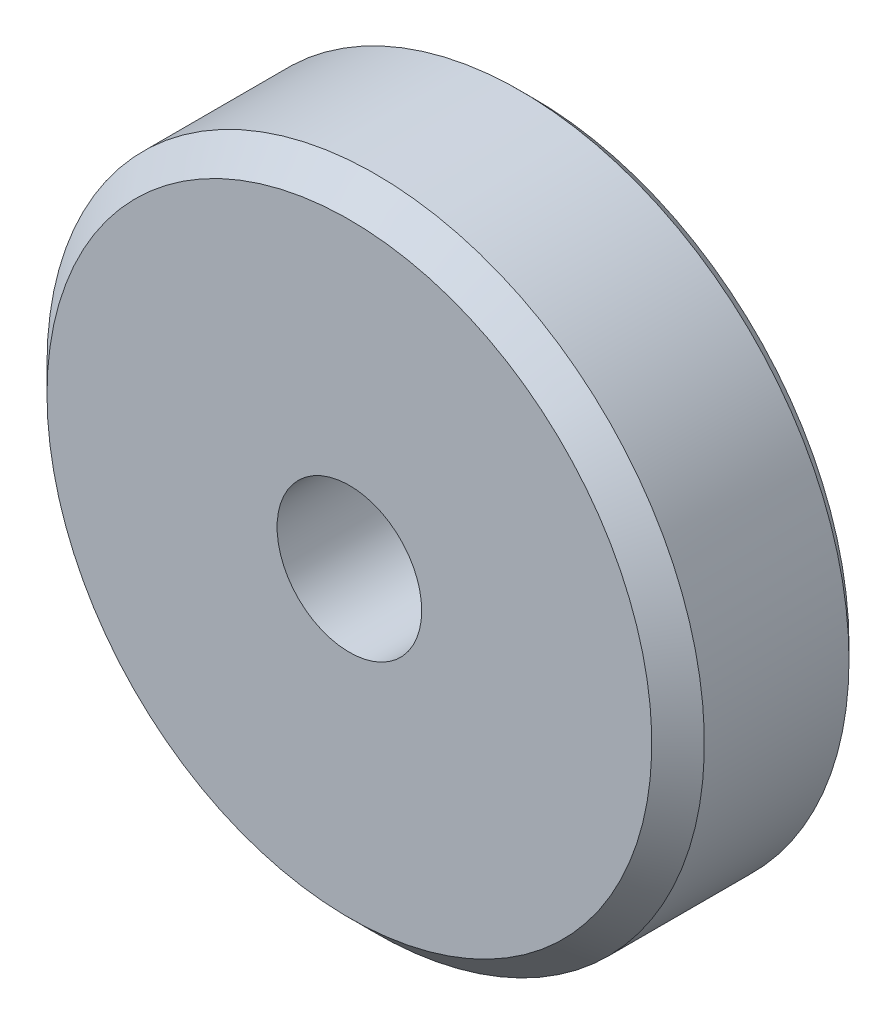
ISO-10303-21;
HEADER;
FILE_DESCRIPTION(('STEP AP214'),'2;1');
FILE_NAME('part.step','',(''),(''),'','','');
FILE_SCHEMA(('AUTOMOTIVE_DESIGN { 1 0 10303 214 1 1 1 1 }'));
ENDSEC;
DATA;
#1=APPLICATION_CONTEXT('core data for automotive mechanical design processes');
#2=APPLICATION_PROTOCOL_DEFINITION('international standard','automotive_design',2000,#1);
#3=PRODUCT_CONTEXT('',#1,'mechanical');
#4=PRODUCT('Part','Part','',(#3));
#5=PRODUCT_RELATED_PRODUCT_CATEGORY('part','',(#4));
#6=PRODUCT_DEFINITION_FORMATION('','',#4);
#7=PRODUCT_DEFINITION_CONTEXT('part definition',#1,'design');
#8=PRODUCT_DEFINITION('design','',#6,#7);
#9=PRODUCT_DEFINITION_SHAPE('','',#8);
#10=(LENGTH_UNIT() NAMED_UNIT(*) SI_UNIT(.MILLI.,.METRE.));
#11=(NAMED_UNIT(*) PLANE_ANGLE_UNIT() SI_UNIT($,.RADIAN.));
#12=(NAMED_UNIT(*) SI_UNIT($,.STERADIAN.) SOLID_ANGLE_UNIT());
#13=UNCERTAINTY_MEASURE_WITH_UNIT(LENGTH_MEASURE(1.E-05),#10,'distance_accuracy_value','');
#14=(GEOMETRIC_REPRESENTATION_CONTEXT(3) GLOBAL_UNCERTAINTY_ASSIGNED_CONTEXT((#13)) GLOBAL_UNIT_ASSIGNED_CONTEXT((#10,
#11,#12)) REPRESENTATION_CONTEXT('',''));
#15=CARTESIAN_POINT('',(0.,0.,0.));
#16=DIRECTION('',(0.,0.,1.));
#17=DIRECTION('',(1.,0.,0.));
#18=AXIS2_PLACEMENT_3D('',#15,#16,#17);
#19=CARTESIAN_POINT('',(0.,6.25000000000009,0.649999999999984));
#20=DIRECTION('',(0.,-1.,0.));
#21=DIRECTION('',(0.,0.,-1.));
#22=AXIS2_PLACEMENT_3D('',#19,#20,#21);
#23=CYLINDRICAL_SURFACE('',#22,1.25);
#24=CARTESIAN_POINT('',(0.,-2.75000000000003,-0.599999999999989));
#25=CARTESIAN_POINT('',(0.0664092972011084,-2.74999722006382,-0.599996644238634));
#26=CARTESIAN_POINT('',(0.132918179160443,-2.74756773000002,-0.594676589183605));
#27=CARTESIAN_POINT('',(0.264013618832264,-2.73809041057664,-0.573611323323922));
#28=CARTESIAN_POINT('',(0.328595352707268,-2.7310318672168,-0.557841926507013));
#29=CARTESIAN_POINT('',(0.453733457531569,-2.71304396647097,-0.516597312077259));
#30=CARTESIAN_POINT('',(0.514303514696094,-2.70212867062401,-0.491157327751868));
#31=CARTESIAN_POINT('',(0.630245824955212,-2.67746302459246,-0.431455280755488));
#32=CARTESIAN_POINT('',(0.68561911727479,-2.66371324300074,-0.39719498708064));
#33=CARTESIAN_POINT('',(0.79287640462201,-2.633838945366,-0.318757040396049));
#34=CARTESIAN_POINT('',(0.844423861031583,-2.61762758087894,-0.274152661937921));
#35=CARTESIAN_POINT('',(0.939605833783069,-2.58499080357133,-0.177200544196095));
#36=CARTESIAN_POINT('',(0.983235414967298,-2.56856526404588,-0.124848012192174));
#37=CARTESIAN_POINT('',(1.06399421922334,-2.53622246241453,-0.0100275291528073));
#38=CARTESIAN_POINT('',(1.10056379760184,-2.52039748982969,0.0528629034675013));
#39=CARTESIAN_POINT('',(1.162456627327,-2.49245983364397,0.18471600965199));
#40=CARTESIAN_POINT('',(1.18778672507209,-2.48034489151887,0.253674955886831));
#41=CARTESIAN_POINT('',(1.22502813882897,-2.46215702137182,0.39184774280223));
#42=CARTESIAN_POINT('',(1.2375915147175,-2.45579257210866,0.460845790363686));
#43=CARTESIAN_POINT('',(1.25096639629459,-2.44900910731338,0.600240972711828));
#44=CARTESIAN_POINT('',(1.25178632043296,-2.44858583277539,0.670637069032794));
#45=CARTESIAN_POINT('',(1.24213570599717,-2.45349076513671,0.803705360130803));
#46=CARTESIAN_POINT('',(1.23272508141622,-2.45827909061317,0.866478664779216));
#47=CARTESIAN_POINT('',(1.20468382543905,-2.47214054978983,0.989433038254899));
#48=CARTESIAN_POINT('',(1.18605099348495,-2.48121470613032,1.04961348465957));
#49=CARTESIAN_POINT('',(1.13972592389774,-2.50283604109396,1.16731828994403));
#50=CARTESIAN_POINT('',(1.11183710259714,-2.51545758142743,1.22475099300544));
#51=CARTESIAN_POINT('',(1.0479342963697,-2.54274244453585,1.33437072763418));
#52=CARTESIAN_POINT('',(1.01191682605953,-2.55740664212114,1.38655549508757));
#53=CARTESIAN_POINT('',(0.928462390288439,-2.58894610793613,1.48982328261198));
#54=CARTESIAN_POINT('',(0.880233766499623,-2.60589402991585,1.54024636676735));
#55=CARTESIAN_POINT('',(0.775874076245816,-2.6388468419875,1.63253413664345));
#56=CARTESIAN_POINT('',(0.719740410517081,-2.65485141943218,1.67439599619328));
#57=CARTESIAN_POINT('',(0.598831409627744,-2.68475267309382,1.74960334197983));
#58=CARTESIAN_POINT('',(0.533836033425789,-2.69856489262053,1.78263123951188));
#59=CARTESIAN_POINT('',(0.398422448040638,-2.7218496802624,1.83704419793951));
#60=CARTESIAN_POINT('',(0.328007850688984,-2.73132511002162,1.8584369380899));
#61=CARTESIAN_POINT('',(0.189224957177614,-2.74430245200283,1.88747768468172));
#62=CARTESIAN_POINT('',(0.12107724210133,-2.74818697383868,1.8960081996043));
#63=CARTESIAN_POINT('',(-0.0157830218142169,-2.75080503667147,1.90177344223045));
#64=CARTESIAN_POINT('',(-0.0844953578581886,-2.74954043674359,1.89901224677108));
#65=CARTESIAN_POINT('',(-0.216073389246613,-2.7422420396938,1.88285709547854));
#66=CARTESIAN_POINT('',(-0.27903906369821,-2.73650576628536,1.87012623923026));
#67=CARTESIAN_POINT('',(-0.401846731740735,-2.72118555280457,1.83536633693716));
#68=CARTESIAN_POINT('',(-0.461688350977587,-2.71160115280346,1.81333617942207));
#69=CARTESIAN_POINT('',(-0.578663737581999,-2.68910907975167,1.75991512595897));
#70=CARTESIAN_POINT('',(-0.635655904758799,-2.6761075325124,1.72825503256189));
#71=CARTESIAN_POINT('',(-0.743723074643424,-2.6481120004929,1.65676622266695));
#72=CARTESIAN_POINT('',(-0.794795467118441,-2.63311714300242,1.61693392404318));
#73=CARTESIAN_POINT('',(-0.894095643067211,-2.60116069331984,1.52634467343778));
#74=CARTESIAN_POINT('',(-0.941725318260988,-2.58413964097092,1.47495155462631));
#75=CARTESIAN_POINT('',(-1.02789777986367,-2.55109013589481,1.36471881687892));
#76=CARTESIAN_POINT('',(-1.066436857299,-2.53506209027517,1.3058761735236));
#77=CARTESIAN_POINT('',(-1.13425708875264,-2.50546837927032,1.18027291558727));
#78=CARTESIAN_POINT('',(-1.16325589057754,-2.49198214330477,1.11333962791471));
#79=CARTESIAN_POINT('',(-1.20928572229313,-2.46997777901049,0.974725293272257));
#80=CARTESIAN_POINT('',(-1.22632915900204,-2.46145450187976,0.903049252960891));
#81=CARTESIAN_POINT('',(-1.24662903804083,-2.45123100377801,0.763718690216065));
#82=CARTESIAN_POINT('',(-1.25095942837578,-2.44899997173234,0.696259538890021));
#83=CARTESIAN_POINT('',(-1.24868510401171,-2.45016089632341,0.56158345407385));
#84=CARTESIAN_POINT('',(-1.24208302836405,-2.45355149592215,0.494366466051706));
#85=CARTESIAN_POINT('',(-1.2190842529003,-2.46505170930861,0.366686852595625));
#86=CARTESIAN_POINT('',(-1.2033599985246,-2.47283643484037,0.306070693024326));
#87=CARTESIAN_POINT('',(-1.16329328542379,-2.4919346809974,0.188353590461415));
#88=CARTESIAN_POINT('',(-1.13894830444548,-2.50324923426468,0.131253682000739));
#89=CARTESIAN_POINT('',(-1.08052106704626,-2.52904242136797,0.0181064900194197));
#90=CARTESIAN_POINT('',(-1.04590750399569,-2.54367923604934,-0.0376295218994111));
#91=CARTESIAN_POINT('',(-0.968596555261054,-2.57411065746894,-0.142834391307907));
#92=CARTESIAN_POINT('',(-0.925895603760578,-2.5899057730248,-0.192300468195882));
#93=CARTESIAN_POINT('',(-0.828924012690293,-2.62263949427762,-0.28832995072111));
#94=CARTESIAN_POINT('',(-0.773945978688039,-2.63954746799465,-0.334193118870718));
#95=CARTESIAN_POINT('',(-0.656497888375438,-2.67118038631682,-0.416131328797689));
#96=CARTESIAN_POINT('',(-0.594024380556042,-2.6859043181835,-0.452201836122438));
#97=CARTESIAN_POINT('',(-0.463719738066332,-2.71142629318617,-0.513008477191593));
#98=CARTESIAN_POINT('',(-0.395940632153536,-2.72225776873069,-0.53784163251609));
#99=CARTESIAN_POINT('',(-0.256651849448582,-2.73888892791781,-0.57548039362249));
#100=CARTESIAN_POINT('',(-0.185154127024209,-2.7447037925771,-0.588322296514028));
#101=CARTESIAN_POINT('',(-0.0943030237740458,-2.74844792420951,-0.596581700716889));
#102=CARTESIAN_POINT('',(-0.0754723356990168,-2.74902888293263,-0.59786228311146));
#103=CARTESIAN_POINT('',(-0.0377637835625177,-2.74980531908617,-0.599571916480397));
#104=CARTESIAN_POINT('',(-0.0188859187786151,-2.75000079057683,-0.600000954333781));
#105=CARTESIAN_POINT('',(0.,-2.75000000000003,-0.599999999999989));
#106=B_SPLINE_CURVE_WITH_KNOTS('',3,(#24,#25,#26,#27,#28,#29,#30,#31,#32,#33,#34,#35,#36,#37,
#38,#39,#40,#41,#42,#43,#44,#45,#46,#47,#48,#49,#50,#51,#52,#53,#54,#55,#56,#57,#58,#59,#60,#61,
#62,#63,#64,#65,#66,#67,#68,#69,#70,#71,#72,#73,#74,#75,#76,#77,#78,#79,#80,#81,#82,#83,#84,#85,
#86,#87,#88,#89,#90,#91,#92,#93,#94,#95,#96,#97,#98,#99,#100,#101,#102,#103,#104,#105),
.UNSPECIFIED.,.T.,.F.,(4,2,2,2,2,2,2,2,2,2,2,2,2,2,2,2,2,2,2,2,2,2,2,2,2,2,2,2,2,2,2,2,2,2,2,2,
2,2,2,2,4),(0.,0.199150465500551,0.398763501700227,0.597656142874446,0.79650892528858,
1.00581702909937,1.21525514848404,1.43748275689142,1.65957481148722,1.86964669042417,
2.07956796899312,2.26964626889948,2.4597699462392,2.65422185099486,2.84875729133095,
3.0632118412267,3.27773707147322,3.49916919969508,3.72045500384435,3.92572957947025,
4.13093004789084,4.32353422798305,4.51616143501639,4.71476455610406,4.91345491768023,
5.1288142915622,5.34426138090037,5.56560701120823,5.78672259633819,5.98852995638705,
6.19028860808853,6.37878337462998,6.56733333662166,6.76817468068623,6.96910478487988,
7.18876214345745,7.40852104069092,7.62634457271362,7.843506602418,7.9001414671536,
7.95677720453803),.UNSPECIFIED.);
#107=CARTESIAN_POINT('',(-1.06770782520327,-2.53426517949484,1.66533453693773E-13));
#108=VERTEX_POINT('',#107);
#109=CARTESIAN_POINT('',(1.06770782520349,-2.53426517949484,-1.66533453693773E-13));
#110=VERTEX_POINT('',#109);
#111=EDGE_CURVE('E73',#108,#110,#106,.T.);
#112=ORIENTED_EDGE('',*,*,#111,.T.);
#113=DIRECTION('',(0.,-1.,0.));
#114=VECTOR('',#113,1.);
#115=CARTESIAN_POINT('',(1.06770782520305,6.24999999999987,0.));
#116=LINE('',#115,#114);
#117=CARTESIAN_POINT('',(1.06770782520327,-6.24999999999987,0.));
#118=VERTEX_POINT('',#117);
#119=EDGE_CURVE('E144',#110,#118,#116,.T.);
#120=ORIENTED_EDGE('',*,*,#119,.T.);
#121=CARTESIAN_POINT('',(0.,-6.24999999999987,0.649999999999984));
#122=DIRECTION('',(0.,1.,0.));
#123=DIRECTION('',(0.,0.,1.));
#124=AXIS2_PLACEMENT_3D('',#121,#122,#123);
#125=CIRCLE('',#124,1.25);
#126=CARTESIAN_POINT('',(-1.06770782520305,-6.24999999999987,0.));
#127=VERTEX_POINT('',#126);
#128=EDGE_CURVE('E88',#118,#127,#125,.T.);
#129=ORIENTED_EDGE('',*,*,#128,.T.);
#130=DIRECTION('',(0.,-1.,0.));
#131=VECTOR('',#130,1.);
#132=CARTESIAN_POINT('',(-1.06770782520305,6.25000000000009,0.));
#133=LINE('',#132,#131);
#134=EDGE_CURVE('E86',#127,#108,#133,.F.);
#135=ORIENTED_EDGE('',*,*,#134,.T.);
#136=EDGE_LOOP('',(#112,#120,#129,#135));
#137=FACE_BOUND('',#136,.T.);
#138=ADVANCED_FACE('F30',(#137),#23,.T.);
#139=CARTESIAN_POINT('',(0.,0.,7.00000000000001));
#140=DIRECTION('',(0.,0.,-1.));
#141=DIRECTION('',(-1.,0.,0.));
#142=AXIS2_PLACEMENT_3D('',#139,#140,#141);
#143=CYLINDRICAL_SURFACE('',#142,12.5);
#144=CARTESIAN_POINT('',(0.,0.,0.5));
#145=DIRECTION('',(0.,0.,1.));
#146=DIRECTION('',(1.,0.,0.));
#147=AXIS2_PLACEMENT_3D('',#144,#145,#146);
#148=CIRCLE('',#147,12.5);
#149=CARTESIAN_POINT('',(-12.5,0.,0.5));
#150=VERTEX_POINT('',#149);
#151=EDGE_CURVE('E38',#150,#150,#148,.T.);
#152=CARTESIAN_POINT('',(0.,0.,6.00000000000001));
#153=DIRECTION('',(0.,0.,1.));
#154=DIRECTION('',(1.,0.,0.));
#155=AXIS2_PLACEMENT_3D('',#152,#153,#154);
#156=CIRCLE('',#155,12.5);
#157=CARTESIAN_POINT('',(-12.5,0.,6.00000000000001));
#158=VERTEX_POINT('',#157);
#159=EDGE_CURVE('E139',#158,#158,#156,.F.);
#160=CARTESIAN_POINT('',(-12.5,0.,0.5));
#161=CARTESIAN_POINT('',(-12.5,0.,0.557291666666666));
#162=CARTESIAN_POINT('',(-12.5,0.,0.614583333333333));
#163=CARTESIAN_POINT('',(-12.5,0.,0.729166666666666));
#164=CARTESIAN_POINT('',(-12.5,0.,0.786458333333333));
#165=CARTESIAN_POINT('',(-12.5,0.,0.901041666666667));
#166=CARTESIAN_POINT('',(-12.5,0.,0.958333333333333));
#167=CARTESIAN_POINT('',(-12.5,0.,1.07291666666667));
#168=CARTESIAN_POINT('',(-12.5,0.,1.13020833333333));
#169=CARTESIAN_POINT('',(-12.5,0.,1.24479166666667));
#170=CARTESIAN_POINT('',(-12.5,0.,1.30208333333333));
#171=CARTESIAN_POINT('',(-12.5,0.,1.41666666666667));
#172=CARTESIAN_POINT('',(-12.5,0.,1.47395833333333));
#173=CARTESIAN_POINT('',(-12.5,0.,1.58854166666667));
#174=CARTESIAN_POINT('',(-12.5,0.,1.64583333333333));
#175=CARTESIAN_POINT('',(-12.5,0.,1.76041666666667));
#176=CARTESIAN_POINT('',(-12.5,0.,1.81770833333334));
#177=CARTESIAN_POINT('',(-12.5,0.,1.93229166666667));
#178=CARTESIAN_POINT('',(-12.5,0.,1.98958333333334));
#179=CARTESIAN_POINT('',(-12.5,0.,2.10416666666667));
#180=CARTESIAN_POINT('',(-12.5,0.,2.16145833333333));
#181=CARTESIAN_POINT('',(-12.5,0.,2.27604166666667));
#182=CARTESIAN_POINT('',(-12.5,0.,2.33333333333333));
#183=CARTESIAN_POINT('',(-12.5,0.,2.44791666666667));
#184=CARTESIAN_POINT('',(-12.5,0.,2.50520833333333));
#185=CARTESIAN_POINT('',(-12.5,0.,2.61979166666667));
#186=CARTESIAN_POINT('',(-12.5,0.,2.67708333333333));
#187=CARTESIAN_POINT('',(-12.5,0.,2.79166666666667));
#188=CARTESIAN_POINT('',(-12.5,0.,2.84895833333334));
#189=CARTESIAN_POINT('',(-12.5,0.,2.96354166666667));
#190=CARTESIAN_POINT('',(-12.5,0.,3.02083333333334));
#191=CARTESIAN_POINT('',(-12.5,0.,3.13541666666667));
#192=CARTESIAN_POINT('',(-12.5,0.,3.19270833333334));
#193=CARTESIAN_POINT('',(-12.5,0.,3.30729166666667));
#194=CARTESIAN_POINT('',(-12.5,0.,3.36458333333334));
#195=CARTESIAN_POINT('',(-12.5,0.,3.47916666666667));
#196=CARTESIAN_POINT('',(-12.5,0.,3.53645833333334));
#197=CARTESIAN_POINT('',(-12.5,0.,3.65104166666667));
#198=CARTESIAN_POINT('',(-12.5,0.,3.70833333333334));
#199=CARTESIAN_POINT('',(-12.5,0.,3.82291666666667));
#200=CARTESIAN_POINT('',(-12.5,0.,3.88020833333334));
#201=CARTESIAN_POINT('',(-12.5,0.,3.99479166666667));
#202=CARTESIAN_POINT('',(-12.5,0.,4.05208333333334));
#203=CARTESIAN_POINT('',(-12.5,0.,4.16666666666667));
#204=CARTESIAN_POINT('',(-12.5,0.,4.22395833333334));
#205=CARTESIAN_POINT('',(-12.5,0.,4.33854166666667));
#206=CARTESIAN_POINT('',(-12.5,0.,4.39583333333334));
#207=CARTESIAN_POINT('',(-12.5,0.,4.51041666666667));
#208=CARTESIAN_POINT('',(-12.5,0.,4.56770833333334));
#209=CARTESIAN_POINT('',(-12.5,0.,4.68229166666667));
#210=CARTESIAN_POINT('',(-12.5,0.,4.73958333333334));
#211=CARTESIAN_POINT('',(-12.5,0.,4.85416666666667));
#212=CARTESIAN_POINT('',(-12.5,0.,4.91145833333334));
#213=CARTESIAN_POINT('',(-12.5,0.,5.02604166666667));
#214=CARTESIAN_POINT('',(-12.5,0.,5.08333333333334));
#215=CARTESIAN_POINT('',(-12.5,0.,5.19791666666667));
#216=CARTESIAN_POINT('',(-12.5,0.,5.25520833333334));
#217=CARTESIAN_POINT('',(-12.5,0.,5.36979166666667));
#218=CARTESIAN_POINT('',(-12.5,0.,5.42708333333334));
#219=CARTESIAN_POINT('',(-12.5,0.,5.54166666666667));
#220=CARTESIAN_POINT('',(-12.5,0.,5.59895833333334));
#221=CARTESIAN_POINT('',(-12.5,0.,5.71354166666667));
#222=CARTESIAN_POINT('',(-12.5,0.,5.77083333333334));
#223=CARTESIAN_POINT('',(-12.5,0.,5.88541666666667));
#224=CARTESIAN_POINT('',(-12.5,0.,5.94270833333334));
#225=CARTESIAN_POINT('',(-12.5,0.,6.00000000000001));
#226=B_SPLINE_CURVE_WITH_KNOTS('',3,(#160,#161,#162,#163,#164,#165,#166,#167,#168,#169,#170,
#171,#172,#173,#174,#175,#176,#177,#178,#179,#180,#181,#182,#183,#184,#185,#186,#187,#188,#189,
#190,#191,#192,#193,#194,#195,#196,#197,#198,#199,#200,#201,#202,#203,#204,#205,#206,#207,#208,
#209,#210,#211,#212,#213,#214,#215,#216,#217,#218,#219,#220,#221,#222,#223,#224,#225),
.UNSPECIFIED.,.F.,.F.,(4,2,2,2,2,2,2,2,2,2,2,2,2,2,2,2,2,2,2,2,2,2,2,2,2,2,2,2,2,2,2,2,4),(0.,
0.171875,0.34375,0.515625,0.687500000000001,0.859375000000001,1.03125,1.203125,1.375,1.546875,
1.71875,1.890625,2.0625,2.234375,2.40625,2.578125,2.75,2.921875,3.09375,3.265625,3.4375,
3.609375,3.78125,3.953125,4.125,4.296875,4.46875,4.64062500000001,4.81250000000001,
4.98437500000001,5.15625000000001,5.32812500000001,5.50000000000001),.UNSPECIFIED.);
#227=EDGE_CURVE('BSEAM32',#150,#158,#226,.T.);
#228=ORIENTED_EDGE('',*,*,#151,.T.);
#229=ORIENTED_EDGE('',*,*,#159,.T.);
#230=ORIENTED_EDGE('',*,*,#227,.T.);
#231=ORIENTED_EDGE('',*,*,#227,.F.);
#232=EDGE_LOOP('',(#228,#230,#229,#231));
#233=FACE_BOUND('',#232,.T.);
#234=ADVANCED_FACE('F32',(#233),#143,.T.);
#235=CARTESIAN_POINT('',(0.,0.,7.00000000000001));
#236=DIRECTION('',(0.,0.,1.));
#237=DIRECTION('',(1.,0.,0.));
#238=AXIS2_PLACEMENT_3D('',#235,#236,#237);
#239=PLANE('',#238);
#240=CARTESIAN_POINT('',(0.,0.,7.00000000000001));
#241=DIRECTION('',(0.,0.,1.));
#242=DIRECTION('',(1.,0.,0.));
#243=AXIS2_PLACEMENT_3D('',#240,#241,#242);
#244=CIRCLE('',#243,2.75);
#245=CARTESIAN_POINT('',(2.75,0.,7.00000000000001));
#246=VERTEX_POINT('',#245);
#247=EDGE_CURVE('E152',#246,#246,#244,.T.);
#248=ORIENTED_EDGE('',*,*,#247,.F.);
#249=EDGE_LOOP('',(#248));
#250=FACE_BOUND('',#249,.T.);
#251=CARTESIAN_POINT('',(0.,0.,7.00000000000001));
#252=DIRECTION('',(0.,0.,1.));
#253=DIRECTION('',(1.,0.,0.));
#254=AXIS2_PLACEMENT_3D('',#251,#252,#253);
#255=CIRCLE('',#254,11.5);
#256=CARTESIAN_POINT('',(-11.5,0.,7.00000000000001));
#257=VERTEX_POINT('',#256);
#258=EDGE_CURVE('E142',#257,#257,#255,.T.);
#259=ORIENTED_EDGE('',*,*,#258,.T.);
#260=EDGE_LOOP('',(#259));
#261=FACE_BOUND('',#260,.T.);
#262=ADVANCED_FACE('F128',(#250,#261),#239,.T.);
#263=CARTESIAN_POINT('',(0.,0.,0.));
#264=DIRECTION('',(0.,0.,1.));
#265=DIRECTION('',(1.,0.,0.));
#266=AXIS2_PLACEMENT_3D('',#263,#264,#265);
#267=PLANE('',#266);
#268=CARTESIAN_POINT('',(0.,0.,0.));
#269=DIRECTION('',(0.,0.,1.));
#270=DIRECTION('',(1.,0.,0.));
#271=AXIS2_PLACEMENT_3D('',#268,#269,#270);
#272=CIRCLE('',#271,12.);
#273=CARTESIAN_POINT('',(12.,0.,0.));
#274=VERTEX_POINT('',#273);
#275=EDGE_CURVE('E11',#274,#274,#272,.F.);
#276=ORIENTED_EDGE('',*,*,#275,.T.);
#277=EDGE_LOOP('',(#276));
#278=FACE_BOUND('',#277,.T.);
#279=CARTESIAN_POINT('',(-1.06770782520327,2.53426517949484,0.));
#280=VERTEX_POINT('',#279);
#281=CARTESIAN_POINT('',(-1.06770782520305,6.25000000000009,0.));
#282=VERTEX_POINT('',#281);
#283=EDGE_CURVE('E45',#280,#282,#133,.F.);
#284=ORIENTED_EDGE('',*,*,#283,.F.);
#285=CARTESIAN_POINT('',(0.,0.,0.));
#286=DIRECTION('',(0.,0.,1.));
#287=DIRECTION('',(1.,0.,0.));
#288=AXIS2_PLACEMENT_3D('',#285,#286,#287);
#289=CIRCLE('',#288,2.75);
#290=EDGE_CURVE('E76',#280,#108,#289,.T.);
#291=ORIENTED_EDGE('',*,*,#290,.T.);
#292=ORIENTED_EDGE('',*,*,#134,.F.);
#293=DIRECTION('',(-1.,0.,0.));
#294=VECTOR('',#293,1.);
#295=CARTESIAN_POINT('',(0.,-6.24999999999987,0.));
#296=LINE('',#295,#294);
#297=EDGE_CURVE('E141',#118,#127,#296,.T.);
#298=ORIENTED_EDGE('',*,*,#297,.F.);
#299=ORIENTED_EDGE('',*,*,#119,.F.);
#300=CARTESIAN_POINT('',(1.06770782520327,2.53426517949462,0.));
#301=VERTEX_POINT('',#300);
#302=EDGE_CURVE('E77',#110,#301,#289,.T.);
#303=ORIENTED_EDGE('',*,*,#302,.T.);
#304=CARTESIAN_POINT('',(1.06770782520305,6.24999999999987,0.));
#305=VERTEX_POINT('',#304);
#306=EDGE_CURVE('E52',#305,#301,#116,.T.);
#307=ORIENTED_EDGE('',*,*,#306,.F.);
#308=DIRECTION('',(-1.,0.,0.));
#309=VECTOR('',#308,1.);
#310=CARTESIAN_POINT('',(0.,6.25000000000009,0.));
#311=LINE('',#310,#309);
#312=EDGE_CURVE('E82',#305,#282,#311,.T.);
#313=ORIENTED_EDGE('',*,*,#312,.T.);
#314=EDGE_LOOP('',(#284,#291,#292,#298,#299,#303,#307,#313));
#315=FACE_BOUND('',#314,.T.);
#316=ADVANCED_FACE('F84',(#278,#315),#267,.F.);
#317=CARTESIAN_POINT('',(0.,0.,7.00000000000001));
#318=DIRECTION('',(0.,0.,-1.));
#319=DIRECTION('',(-1.,0.,0.));
#320=AXIS2_PLACEMENT_3D('',#317,#318,#319);
#321=CONICAL_SURFACE('',#320,11.5,0.785398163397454);
#322=CARTESIAN_POINT('',(-12.5,0.,6.00000000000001));
#323=CARTESIAN_POINT('',(-12.4895833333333,0.,6.01041666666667));
#324=CARTESIAN_POINT('',(-12.4791666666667,0.,6.02083333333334));
#325=CARTESIAN_POINT('',(-12.4583333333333,0.,6.04166666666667));
#326=CARTESIAN_POINT('',(-12.4479166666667,0.,6.05208333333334));
#327=CARTESIAN_POINT('',(-12.4270833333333,0.,6.07291666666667));
#328=CARTESIAN_POINT('',(-12.4166666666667,0.,6.08333333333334));
#329=CARTESIAN_POINT('',(-12.3958333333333,0.,6.10416666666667));
#330=CARTESIAN_POINT('',(-12.3854166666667,0.,6.11458333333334));
#331=CARTESIAN_POINT('',(-12.3645833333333,0.,6.13541666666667));
#332=CARTESIAN_POINT('',(-12.3541666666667,0.,6.14583333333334));
#333=CARTESIAN_POINT('',(-12.3333333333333,0.,6.16666666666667));
#334=CARTESIAN_POINT('',(-12.3229166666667,0.,6.17708333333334));
#335=CARTESIAN_POINT('',(-12.3020833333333,0.,6.19791666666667));
#336=CARTESIAN_POINT('',(-12.2916666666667,0.,6.20833333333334));
#337=CARTESIAN_POINT('',(-12.2708333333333,0.,6.22916666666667));
#338=CARTESIAN_POINT('',(-12.2604166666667,0.,6.23958333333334));
#339=CARTESIAN_POINT('',(-12.2395833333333,0.,6.26041666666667));
#340=CARTESIAN_POINT('',(-12.2291666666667,0.,6.27083333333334));
#341=CARTESIAN_POINT('',(-12.2083333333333,0.,6.29166666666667));
#342=CARTESIAN_POINT('',(-12.1979166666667,0.,6.30208333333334));
#343=CARTESIAN_POINT('',(-12.1770833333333,0.,6.32291666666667));
#344=CARTESIAN_POINT('',(-12.1666666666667,0.,6.33333333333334));
#345=CARTESIAN_POINT('',(-12.1458333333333,0.,6.35416666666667));
#346=CARTESIAN_POINT('',(-12.1354166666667,0.,6.36458333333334));
#347=CARTESIAN_POINT('',(-12.1145833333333,0.,6.38541666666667));
#348=CARTESIAN_POINT('',(-12.1041666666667,0.,6.39583333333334));
#349=CARTESIAN_POINT('',(-12.0833333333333,0.,6.41666666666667));
#350=CARTESIAN_POINT('',(-12.0729166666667,0.,6.42708333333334));
#351=CARTESIAN_POINT('',(-12.0520833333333,0.,6.44791666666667));
#352=CARTESIAN_POINT('',(-12.0416666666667,0.,6.45833333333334));
#353=CARTESIAN_POINT('',(-12.0208333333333,0.,6.47916666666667));
#354=CARTESIAN_POINT('',(-12.0104166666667,0.,6.48958333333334));
#355=CARTESIAN_POINT('',(-11.9895833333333,0.,6.51041666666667));
#356=CARTESIAN_POINT('',(-11.9791666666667,0.,6.52083333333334));
#357=CARTESIAN_POINT('',(-11.9583333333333,0.,6.54166666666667));
#358=CARTESIAN_POINT('',(-11.9479166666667,0.,6.55208333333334));
#359=CARTESIAN_POINT('',(-11.9270833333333,0.,6.57291666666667));
#360=CARTESIAN_POINT('',(-11.9166666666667,0.,6.58333333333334));
#361=CARTESIAN_POINT('',(-11.8958333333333,0.,6.60416666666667));
#362=CARTESIAN_POINT('',(-11.8854166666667,0.,6.61458333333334));
#363=CARTESIAN_POINT('',(-11.8645833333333,0.,6.63541666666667));
#364=CARTESIAN_POINT('',(-11.8541666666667,0.,6.64583333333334));
#365=CARTESIAN_POINT('',(-11.8333333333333,0.,6.66666666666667));
#366=CARTESIAN_POINT('',(-11.8229166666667,0.,6.67708333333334));
#367=CARTESIAN_POINT('',(-11.8020833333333,0.,6.69791666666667));
#368=CARTESIAN_POINT('',(-11.7916666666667,0.,6.70833333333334));
#369=CARTESIAN_POINT('',(-11.7708333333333,0.,6.72916666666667));
#370=CARTESIAN_POINT('',(-11.7604166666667,0.,6.73958333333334));
#371=CARTESIAN_POINT('',(-11.7395833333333,0.,6.76041666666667));
#372=CARTESIAN_POINT('',(-11.7291666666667,0.,6.77083333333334));
#373=CARTESIAN_POINT('',(-11.7083333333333,0.,6.79166666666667));
#374=CARTESIAN_POINT('',(-11.6979166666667,0.,6.80208333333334));
#375=CARTESIAN_POINT('',(-11.6770833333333,0.,6.82291666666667));
#376=CARTESIAN_POINT('',(-11.6666666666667,0.,6.83333333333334));
#377=CARTESIAN_POINT('',(-11.6458333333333,0.,6.85416666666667));
#378=CARTESIAN_POINT('',(-11.6354166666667,0.,6.86458333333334));
#379=CARTESIAN_POINT('',(-11.6145833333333,0.,6.88541666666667));
#380=CARTESIAN_POINT('',(-11.6041666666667,0.,6.89583333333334));
#381=CARTESIAN_POINT('',(-11.5833333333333,0.,6.91666666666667));
#382=CARTESIAN_POINT('',(-11.5729166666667,0.,6.92708333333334));
#383=CARTESIAN_POINT('',(-11.5520833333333,0.,6.94791666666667));
#384=CARTESIAN_POINT('',(-11.5416666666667,0.,6.95833333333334));
#385=CARTESIAN_POINT('',(-11.5208333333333,0.,6.97916666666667));
#386=CARTESIAN_POINT('',(-11.5104166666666,0.,6.98958333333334));
#387=CARTESIAN_POINT('',(-11.5,0.,7.00000000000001));
#388=B_SPLINE_CURVE_WITH_KNOTS('',3,(#322,#323,#324,#325,#326,#327,#328,#329,#330,#331,#332,
#333,#334,#335,#336,#337,#338,#339,#340,#341,#342,#343,#344,#345,#346,#347,#348,#349,#350,#351,
#352,#353,#354,#355,#356,#357,#358,#359,#360,#361,#362,#363,#364,#365,#366,#367,#368,#369,#370,
#371,#372,#373,#374,#375,#376,#377,#378,#379,#380,#381,#382,#383,#384,#385,#386,#387),
.UNSPECIFIED.,.F.,.F.,(4,2,2,2,2,2,2,2,2,2,2,2,2,2,2,2,2,2,2,2,2,2,2,2,2,2,2,2,2,2,2,2,4),(0.,
0.0441941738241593,0.0883883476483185,0.132582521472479,0.176776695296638,0.220970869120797,
0.265165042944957,0.309359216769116,0.353553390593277,0.397747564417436,0.441941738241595,
0.486135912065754,0.530330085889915,0.574524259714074,0.618718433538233,0.662912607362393,
0.707106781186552,0.751300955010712,0.795495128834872,0.83968930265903,0.88388347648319,
0.928077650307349,0.97227182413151,1.01646599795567,1.06066017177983,1.10485434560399,
1.14904851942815,1.19324269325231,1.23743686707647,1.28163104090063,1.32582521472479,
1.37001938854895,1.41421356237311),.UNSPECIFIED.);
#389=EDGE_CURVE('BSEAM123',#158,#257,#388,.T.);
#390=ORIENTED_EDGE('',*,*,#159,.F.);
#391=ORIENTED_EDGE('',*,*,#258,.F.);
#392=ORIENTED_EDGE('',*,*,#389,.T.);
#393=ORIENTED_EDGE('',*,*,#389,.F.);
#394=EDGE_LOOP('',(#390,#392,#391,#393));
#395=FACE_BOUND('',#394,.T.);
#396=ADVANCED_FACE('F123',(#395),#321,.T.);
#397=CARTESIAN_POINT('',(2.22044604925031E-13,2.75000000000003,-0.599999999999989));
#398=CARTESIAN_POINT('',(-0.0664092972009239,2.74999722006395,-0.59999664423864));
#399=CARTESIAN_POINT('',(-0.132918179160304,2.74756773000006,-0.59467658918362));
#400=CARTESIAN_POINT('',(-0.2640136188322,2.73809041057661,-0.573611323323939));
#401=CARTESIAN_POINT('',(-0.328595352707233,2.73103186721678,-0.557841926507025));
#402=CARTESIAN_POINT('',(-0.453733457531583,2.713043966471,-0.516597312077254));
#403=CARTESIAN_POINT('',(-0.514303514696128,2.70212867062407,-0.491157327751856));
#404=CARTESIAN_POINT('',(-0.630245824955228,2.67746302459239,-0.431455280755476));
#405=CARTESIAN_POINT('',(-0.685619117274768,2.66371324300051,-0.397194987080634));
#406=CARTESIAN_POINT('',(-0.792876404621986,2.6338389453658,-0.318757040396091));
#407=CARTESIAN_POINT('',(-0.844423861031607,2.61762758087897,-0.27415266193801));
#408=CARTESIAN_POINT('',(-0.9396058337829,2.58499080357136,-0.177200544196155));
#409=CARTESIAN_POINT('',(-0.983235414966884,2.56856526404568,-0.124848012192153));
#410=CARTESIAN_POINT('',(-1.06399421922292,2.53622246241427,-0.0100275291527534));
#411=CARTESIAN_POINT('',(-1.10056379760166,2.52039748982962,0.0528629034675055));
#412=CARTESIAN_POINT('',(-1.16245662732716,2.49245983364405,0.184716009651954));
#413=CARTESIAN_POINT('',(-1.18778672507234,2.48034489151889,0.253674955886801));
#414=CARTESIAN_POINT('',(-1.22502813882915,2.4621570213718,0.391847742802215));
#415=CARTESIAN_POINT('',(-1.23759151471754,2.45579257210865,0.460845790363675));
#416=CARTESIAN_POINT('',(-1.25096639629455,2.44900910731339,0.600240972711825));
#417=CARTESIAN_POINT('',(-1.25178632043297,2.44858583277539,0.670637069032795));
#418=CARTESIAN_POINT('',(-1.24213570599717,2.45349076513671,0.803705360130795));
#419=CARTESIAN_POINT('',(-1.23272508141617,2.45827909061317,0.866478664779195));
#420=CARTESIAN_POINT('',(-1.2046838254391,2.47214054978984,0.989433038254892));
#421=CARTESIAN_POINT('',(-1.18605099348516,2.48121470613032,1.04961348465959));
#422=CARTESIAN_POINT('',(-1.13972592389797,2.50283604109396,1.16731828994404));
#423=CARTESIAN_POINT('',(-1.11183710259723,2.51545758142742,1.2247509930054));
#424=CARTESIAN_POINT('',(-1.04793429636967,2.54274244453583,1.33437072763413));
#425=CARTESIAN_POINT('',(-1.01191682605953,2.55740664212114,1.38655549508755));
#426=CARTESIAN_POINT('',(-0.928462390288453,2.58894610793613,1.48982328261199));
#427=CARTESIAN_POINT('',(-0.880233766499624,2.60589402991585,1.54024636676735));
#428=CARTESIAN_POINT('',(-0.775874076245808,2.6388468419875,1.63253413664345));
#429=CARTESIAN_POINT('',(-0.719740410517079,2.65485141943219,1.67439599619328));
#430=CARTESIAN_POINT('',(-0.598831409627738,2.68475267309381,1.74960334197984));
#431=CARTESIAN_POINT('',(-0.533836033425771,2.69856489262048,1.78263123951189));
#432=CARTESIAN_POINT('',(-0.398422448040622,2.72184968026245,1.83704419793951));
#433=CARTESIAN_POINT('',(-0.328007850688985,2.73132511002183,1.8584369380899));
#434=CARTESIAN_POINT('',(-0.189224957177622,2.74430245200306,1.88747768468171));
#435=CARTESIAN_POINT('',(-0.12107724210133,2.74818697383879,1.8960081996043));
#436=CARTESIAN_POINT('',(0.0157830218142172,2.75080503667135,1.90177344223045));
#437=CARTESIAN_POINT('',(0.0844953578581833,2.74954043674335,1.89901224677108));
#438=CARTESIAN_POINT('',(0.216073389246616,2.7422420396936,1.88285709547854));
#439=CARTESIAN_POINT('',(0.279039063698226,2.73650576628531,1.87012623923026));
#440=CARTESIAN_POINT('',(0.401846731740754,2.72118555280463,1.83536633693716));
#441=CARTESIAN_POINT('',(0.461688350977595,2.71160115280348,1.81333617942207));
#442=CARTESIAN_POINT('',(0.578663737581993,2.68910907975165,1.75991512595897));
#443=CARTESIAN_POINT('',(0.635655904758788,2.6761075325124,1.72825503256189));
#444=CARTESIAN_POINT('',(0.74372307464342,2.6481120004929,1.65676622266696));
#445=CARTESIAN_POINT('',(0.794795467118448,2.63311714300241,1.61693392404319));
#446=CARTESIAN_POINT('',(0.894095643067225,2.60116069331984,1.52634467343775));
#447=CARTESIAN_POINT('',(0.941725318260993,2.58413964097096,1.47495155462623));
#448=CARTESIAN_POINT('',(1.02789777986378,2.55109013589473,1.36471881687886));
#449=CARTESIAN_POINT('',(1.06643685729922,2.53506209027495,1.30587617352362));
#450=CARTESIAN_POINT('',(1.13425708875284,2.5054683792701,1.1802729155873));
#451=CARTESIAN_POINT('',(1.16325589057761,2.4919821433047,1.11333962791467));
#452=CARTESIAN_POINT('',(1.2092857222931,2.46997777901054,0.974725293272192));
#453=CARTESIAN_POINT('',(1.22632915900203,2.46145450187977,0.903049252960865));
#454=CARTESIAN_POINT('',(1.24662903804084,2.451231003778,0.763718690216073));
#455=CARTESIAN_POINT('',(1.25095942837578,2.44899997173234,0.696259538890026));
#456=CARTESIAN_POINT('',(1.24868510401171,2.45016089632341,0.561583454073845));
#457=CARTESIAN_POINT('',(1.24208302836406,2.45355149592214,0.494366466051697));
#458=CARTESIAN_POINT('',(1.21908425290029,2.46505170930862,0.366686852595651));
#459=CARTESIAN_POINT('',(1.20335999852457,2.47283643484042,0.306070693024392));
#460=CARTESIAN_POINT('',(1.16329328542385,2.49193468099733,0.188353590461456));
#461=CARTESIAN_POINT('',(1.13894830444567,2.50324923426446,0.131253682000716));
#462=CARTESIAN_POINT('',(1.0805210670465,2.52904242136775,0.0181064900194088));
#463=CARTESIAN_POINT('',(1.04590750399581,2.54367923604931,-0.0376295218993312));
#464=CARTESIAN_POINT('',(0.968596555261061,2.57411065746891,-0.142834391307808));
#465=CARTESIAN_POINT('',(0.925895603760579,2.58990577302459,-0.192300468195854));
#466=CARTESIAN_POINT('',(0.82892401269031,2.62263949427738,-0.288329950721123));
#467=CARTESIAN_POINT('',(0.773945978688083,2.63954746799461,-0.334193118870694));
#468=CARTESIAN_POINT('',(0.656497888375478,2.67118038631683,-0.416131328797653));
#469=CARTESIAN_POINT('',(0.594024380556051,2.68590431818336,-0.452201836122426));
#470=CARTESIAN_POINT('',(0.463719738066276,2.71142629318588,-0.513008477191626));
#471=CARTESIAN_POINT('',(0.395940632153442,2.72225776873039,-0.537841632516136));
#472=CARTESIAN_POINT('',(0.256651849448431,2.73888892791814,-0.57548039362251));
#473=CARTESIAN_POINT('',(0.185154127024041,2.74470379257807,-0.588322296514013));
#474=CARTESIAN_POINT('',(0.0943030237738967,2.74844792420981,-0.596581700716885));
#475=CARTESIAN_POINT('',(0.0754723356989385,2.74902888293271,-0.597862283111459));
#476=CARTESIAN_POINT('',(0.0377637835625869,2.74980531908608,-0.599571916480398));
#477=CARTESIAN_POINT('',(0.018885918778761,2.75000079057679,-0.600000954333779));
#478=CARTESIAN_POINT('',(2.22044604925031E-13,2.75000000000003,-0.599999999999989));
#479=B_SPLINE_CURVE_WITH_KNOTS('',3,(#397,#398,#399,#400,#401,#402,#403,#404,#405,#406,#407,
#408,#409,#410,#411,#412,#413,#414,#415,#416,#417,#418,#419,#420,#421,#422,#423,#424,#425,#426,
#427,#428,#429,#430,#431,#432,#433,#434,#435,#436,#437,#438,#439,#440,#441,#442,#443,#444,#445,
#446,#447,#448,#449,#450,#451,#452,#453,#454,#455,#456,#457,#458,#459,#460,#461,#462,#463,#464,
#465,#466,#467,#468,#469,#470,#471,#472,#473,#474,#475,#476,#477,#478),.UNSPECIFIED.,.T.,.F.,(4,
2,2,2,2,2,2,2,2,2,2,2,2,2,2,2,2,2,2,2,2,2,2,2,2,2,2,2,2,2,2,2,2,2,2,2,2,2,2,2,4),(0.,
0.199150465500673,0.398763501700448,0.597656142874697,0.796508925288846,1.00581702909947,
1.21525514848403,1.43748275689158,1.65957481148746,1.86964669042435,2.07956796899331,
2.26964626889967,2.45976994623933,2.65422185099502,2.84875729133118,3.06321184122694,
3.27773707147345,3.49916919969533,3.72045500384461,3.92572957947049,4.13093004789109,
4.3235342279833,4.51616143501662,4.71476455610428,4.91345491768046,5.12881429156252,
5.34426138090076,5.56560701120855,5.78672259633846,5.98852995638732,6.1902886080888,
6.3787833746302,6.56733333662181,6.76817468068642,6.96910478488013,7.1887621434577,
7.40852104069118,7.62634457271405,7.84350660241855,7.90014146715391,7.95677720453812),.UNSPECIFIED.);
#480=EDGE_CURVE('E81',#301,#280,#479,.T.);
#481=ORIENTED_EDGE('',*,*,#480,.T.);
#482=ORIENTED_EDGE('',*,*,#283,.T.);
#483=CARTESIAN_POINT('',(0.,6.25000000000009,0.649999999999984));
#484=DIRECTION('',(0.,1.,0.));
#485=DIRECTION('',(0.,0.,1.));
#486=AXIS2_PLACEMENT_3D('',#483,#484,#485);
#487=CIRCLE('',#486,1.25);
#488=EDGE_CURVE('E146',#305,#282,#487,.T.);
#489=ORIENTED_EDGE('',*,*,#488,.F.);
#490=ORIENTED_EDGE('',*,*,#306,.T.);
#491=EDGE_LOOP('',(#481,#482,#489,#490));
#492=FACE_BOUND('',#491,.T.);
#493=ADVANCED_FACE('F103',(#492),#23,.T.);
#494=CARTESIAN_POINT('',(0.,6.25000000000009,0.649999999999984));
#495=DIRECTION('',(0.,1.,0.));
#496=DIRECTION('',(0.,0.,1.));
#497=AXIS2_PLACEMENT_3D('',#494,#495,#496);
#498=PLANE('',#497);
#499=ORIENTED_EDGE('',*,*,#312,.F.);
#500=ORIENTED_EDGE('',*,*,#488,.T.);
#501=EDGE_LOOP('',(#499,#500));
#502=FACE_BOUND('',#501,.T.);
#503=ADVANCED_FACE('F116',(#502),#498,.T.);
#504=CARTESIAN_POINT('',(0.,-6.24999999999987,0.649999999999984));
#505=DIRECTION('',(0.,1.,0.));
#506=DIRECTION('',(0.,0.,1.));
#507=AXIS2_PLACEMENT_3D('',#504,#505,#506);
#508=PLANE('',#507);
#509=ORIENTED_EDGE('',*,*,#128,.F.);
#510=ORIENTED_EDGE('',*,*,#297,.T.);
#511=EDGE_LOOP('',(#509,#510));
#512=FACE_BOUND('',#511,.T.);
#513=ADVANCED_FACE('F112',(#512),#508,.F.);
#514=CARTESIAN_POINT('',(0.,0.,-0.599999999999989));
#515=DIRECTION('',(0.,0.,0.999999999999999));
#516=DIRECTION('',(1.,0.,0.));
#517=AXIS2_PLACEMENT_3D('',#514,#515,#516);
#518=CYLINDRICAL_SURFACE('',#517,2.75);
#519=ORIENTED_EDGE('',*,*,#247,.T.);
#520=EDGE_LOOP('',(#519));
#521=FACE_BOUND('',#520,.T.);
#522=ORIENTED_EDGE('',*,*,#480,.F.);
#523=ORIENTED_EDGE('',*,*,#302,.F.);
#524=ORIENTED_EDGE('',*,*,#111,.F.);
#525=ORIENTED_EDGE('',*,*,#290,.F.);
#526=EDGE_LOOP('',(#522,#523,#524,#525));
#527=FACE_BOUND('',#526,.T.);
#528=ADVANCED_FACE('F75',(#521,#527),#518,.F.);
#529=CARTESIAN_POINT('',(0.,0.,0.5));
#530=DIRECTION('',(0.,0.,1.));
#531=DIRECTION('',(1.,0.,0.));
#532=AXIS2_PLACEMENT_3D('',#529,#530,#531);
#533=CONICAL_SURFACE('',#532,12.5,0.785398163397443);
#534=ORIENTED_EDGE('',*,*,#275,.F.);
#535=EDGE_LOOP('',(#534));
#536=FACE_BOUND('',#535,.T.);
#537=ORIENTED_EDGE('',*,*,#151,.F.);
#538=EDGE_LOOP('',(#537));
#539=FACE_BOUND('',#538,.T.);
#540=ADVANCED_FACE('F111',(#536,#539),#533,.T.);
#541=CLOSED_SHELL('',(#138,#234,#262,#316,#396,#493,#503,#513,#528,#540));
#542=MANIFOLD_SOLID_BREP('B2',#541);
#543=ADVANCED_BREP_SHAPE_REPRESENTATION('',(#18,#542),#14);
#544=SHAPE_DEFINITION_REPRESENTATION(#9,#543);
ENDSEC;
END-ISO-10303-21;
